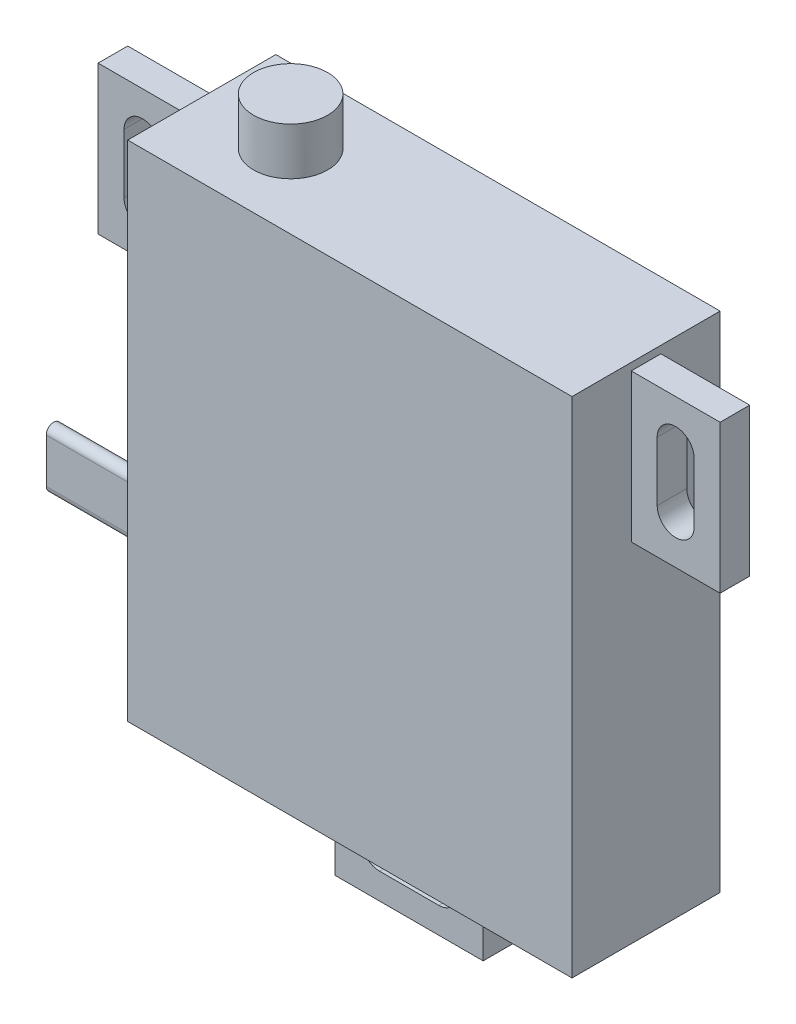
ISO-10303-21;
HEADER;
FILE_DESCRIPTION(('STEP AP214'),'2;1');
FILE_NAME('part.step','',(''),(''),'','','');
FILE_SCHEMA(('AUTOMOTIVE_DESIGN { 1 0 10303 214 1 1 1 1 }'));
ENDSEC;
DATA;
#1=APPLICATION_CONTEXT('core data for automotive mechanical design processes');
#2=APPLICATION_PROTOCOL_DEFINITION('international standard','automotive_design',2000,#1);
#3=PRODUCT_CONTEXT('',#1,'mechanical');
#4=PRODUCT('Part','Part','',(#3));
#5=PRODUCT_RELATED_PRODUCT_CATEGORY('part','',(#4));
#6=PRODUCT_DEFINITION_FORMATION('','',#4);
#7=PRODUCT_DEFINITION_CONTEXT('part definition',#1,'design');
#8=PRODUCT_DEFINITION('design','',#6,#7);
#9=PRODUCT_DEFINITION_SHAPE('','',#8);
#10=(LENGTH_UNIT() NAMED_UNIT(*) SI_UNIT(.MILLI.,.METRE.));
#11=(NAMED_UNIT(*) PLANE_ANGLE_UNIT() SI_UNIT($,.RADIAN.));
#12=(NAMED_UNIT(*) SI_UNIT($,.STERADIAN.) SOLID_ANGLE_UNIT());
#13=UNCERTAINTY_MEASURE_WITH_UNIT(LENGTH_MEASURE(1.E-05),#10,'distance_accuracy_value','');
#14=(GEOMETRIC_REPRESENTATION_CONTEXT(3) GLOBAL_UNCERTAINTY_ASSIGNED_CONTEXT((#13)) GLOBAL_UNIT_ASSIGNED_CONTEXT((#10,
#11,#12)) REPRESENTATION_CONTEXT('',''));
#15=CARTESIAN_POINT('',(0.,0.,0.));
#16=DIRECTION('',(0.,0.,1.));
#17=DIRECTION('',(1.,0.,0.));
#18=AXIS2_PLACEMENT_3D('',#15,#16,#17);
#19=CARTESIAN_POINT('',(0.,34.,5.));
#20=DIRECTION('',(0.,-1.,0.));
#21=DIRECTION('',(0.,0.,-1.));
#22=AXIS2_PLACEMENT_3D('',#19,#20,#21);
#23=PLANE('',#22);
#24=DIRECTION('',(-1.,0.,0.));
#25=VECTOR('',#24,1.);
#26=CARTESIAN_POINT('',(0.,34.,-5.));
#27=LINE('',#26,#25);
#28=CARTESIAN_POINT('',(30.,34.,-5.));
#29=VERTEX_POINT('',#28);
#30=CARTESIAN_POINT('',(0.,34.,-5.));
#31=VERTEX_POINT('',#30);
#32=EDGE_CURVE('E459',#29,#31,#27,.T.);
#33=ORIENTED_EDGE('',*,*,#32,.T.);
#34=DIRECTION('',(0.,0.,-1.));
#35=VECTOR('',#34,1.);
#36=CARTESIAN_POINT('',(0.,34.,5.));
#37=LINE('',#36,#35);
#38=CARTESIAN_POINT('',(0.,34.,5.));
#39=VERTEX_POINT('',#38);
#40=EDGE_CURVE('E465',#39,#31,#37,.T.);
#41=ORIENTED_EDGE('',*,*,#40,.F.);
#42=DIRECTION('',(-1.,0.,0.));
#43=VECTOR('',#42,1.);
#44=CARTESIAN_POINT('',(0.,34.,5.));
#45=LINE('',#44,#43);
#46=CARTESIAN_POINT('',(30.,34.,5.));
#47=VERTEX_POINT('',#46);
#48=EDGE_CURVE('E463',#47,#39,#45,.T.);
#49=ORIENTED_EDGE('',*,*,#48,.F.);
#50=DIRECTION('',(0.,0.,-1.));
#51=VECTOR('',#50,1.);
#52=CARTESIAN_POINT('',(30.,34.,5.));
#53=LINE('',#52,#51);
#54=EDGE_CURVE('E475',#47,#29,#53,.T.);
#55=ORIENTED_EDGE('',*,*,#54,.T.);
#56=EDGE_LOOP('',(#33,#41,#49,#55));
#57=FACE_BOUND('',#56,.T.);
#58=CARTESIAN_POINT('',(6.,34.,0.));
#59=DIRECTION('',(0.,-1.,0.));
#60=DIRECTION('',(0.,0.,-1.));
#61=AXIS2_PLACEMENT_3D('',#58,#59,#60);
#62=CIRCLE('',#61,2.5);
#63=CARTESIAN_POINT('',(6.,34.,-2.5));
#64=VERTEX_POINT('',#63);
#65=EDGE_CURVE('E11',#64,#64,#62,.F.);
#66=ORIENTED_EDGE('',*,*,#65,.F.);
#67=EDGE_LOOP('',(#66));
#68=FACE_BOUND('',#67,.T.);
#69=ADVANCED_FACE('F34',(#57,#68),#23,.F.);
#70=CARTESIAN_POINT('',(0.,0.,5.));
#71=DIRECTION('',(1.,0.,0.));
#72=DIRECTION('',(0.,0.,-1.));
#73=AXIS2_PLACEMENT_3D('',#70,#71,#72);
#74=PLANE('',#73);
#75=DIRECTION('',(0.,0.,-1.));
#76=VECTOR('',#75,1.);
#77=CARTESIAN_POINT('',(0.,33.5,1.));
#78=LINE('',#77,#76);
#79=CARTESIAN_POINT('',(0.,33.5,1.));
#80=VERTEX_POINT('',#79);
#81=CARTESIAN_POINT('',(0.,33.5,-1.));
#82=VERTEX_POINT('',#81);
#83=EDGE_CURVE('E390',#80,#82,#78,.T.);
#84=ORIENTED_EDGE('',*,*,#83,.F.);
#85=DIRECTION('',(0.,1.,0.));
#86=VECTOR('',#85,1.);
#87=CARTESIAN_POINT('',(0.,33.5,1.));
#88=LINE('',#87,#86);
#89=CARTESIAN_POINT('',(0.,23.5,1.));
#90=VERTEX_POINT('',#89);
#91=EDGE_CURVE('E364',#90,#80,#88,.T.);
#92=ORIENTED_EDGE('',*,*,#91,.F.);
#93=DIRECTION('',(0.,0.,-1.));
#94=VECTOR('',#93,1.);
#95=CARTESIAN_POINT('',(0.,23.5,1.));
#96=LINE('',#95,#94);
#97=CARTESIAN_POINT('',(0.,23.5,-1.));
#98=VERTEX_POINT('',#97);
#99=EDGE_CURVE('E375',#90,#98,#96,.T.);
#100=ORIENTED_EDGE('',*,*,#99,.T.);
#101=DIRECTION('',(0.,1.,0.));
#102=VECTOR('',#101,1.);
#103=CARTESIAN_POINT('',(0.,33.5,-1.));
#104=LINE('',#103,#102);
#105=EDGE_CURVE('E363',#98,#82,#104,.T.);
#106=ORIENTED_EDGE('',*,*,#105,.T.);
#107=EDGE_LOOP('',(#84,#92,#100,#106));
#108=FACE_BOUND('',#107,.T.);
#109=DIRECTION('',(0.,-1.,0.));
#110=VECTOR('',#109,1.);
#111=CARTESIAN_POINT('',(0.,0.,-5.));
#112=LINE('',#111,#110);
#113=CARTESIAN_POINT('',(0.,0.,-5.));
#114=VERTEX_POINT('',#113);
#115=EDGE_CURVE('E454',#31,#114,#112,.T.);
#116=ORIENTED_EDGE('',*,*,#115,.T.);
#117=DIRECTION('',(0.,0.,-1.));
#118=VECTOR('',#117,1.);
#119=CARTESIAN_POINT('',(0.,0.,5.));
#120=LINE('',#119,#118);
#121=CARTESIAN_POINT('',(0.,0.,5.));
#122=VERTEX_POINT('',#121);
#123=EDGE_CURVE('E42',#122,#114,#120,.T.);
#124=ORIENTED_EDGE('',*,*,#123,.F.);
#125=DIRECTION('',(0.,-1.,0.));
#126=VECTOR('',#125,1.);
#127=CARTESIAN_POINT('',(0.,0.,5.));
#128=LINE('',#127,#126);
#129=EDGE_CURVE('E455',#39,#122,#128,.T.);
#130=ORIENTED_EDGE('',*,*,#129,.F.);
#131=ORIENTED_EDGE('',*,*,#40,.T.);
#132=EDGE_LOOP('',(#116,#124,#130,#131));
#133=FACE_BOUND('',#132,.T.);
#134=CARTESIAN_POINT('',(0.,6.5,0.));
#135=DIRECTION('',(-1.,0.,0.));
#136=DIRECTION('',(0.,0.,-1.));
#137=AXIS2_PLACEMENT_3D('',#134,#135,#136);
#138=CIRCLE('',#137,0.5);
#139=CARTESIAN_POINT('',(0.,6.5,-0.499999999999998));
#140=VERTEX_POINT('',#139);
#141=CARTESIAN_POINT('',(0.,6.5,0.500000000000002));
#142=VERTEX_POINT('',#141);
#143=EDGE_CURVE('E263',#140,#142,#138,.T.);
#144=ORIENTED_EDGE('',*,*,#143,.F.);
#145=DIRECTION('',(0.,-1.,0.));
#146=VECTOR('',#145,1.);
#147=CARTESIAN_POINT('',(0.,6.5,-0.499999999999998));
#148=LINE('',#147,#146);
#149=CARTESIAN_POINT('',(0.,9.49999987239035,-0.499999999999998));
#150=VERTEX_POINT('',#149);
#151=EDGE_CURVE('E260',#150,#140,#148,.T.);
#152=ORIENTED_EDGE('',*,*,#151,.F.);
#153=CARTESIAN_POINT('',(0.,9.5,0.));
#154=DIRECTION('',(-1.,0.,0.));
#155=DIRECTION('',(0.,0.,-1.));
#156=AXIS2_PLACEMENT_3D('',#153,#154,#155);
#157=CIRCLE('',#156,0.500000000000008);
#158=CARTESIAN_POINT('',(0.,9.5,0.500000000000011));
#159=VERTEX_POINT('',#158);
#160=EDGE_CURVE('E54',#159,#150,#157,.T.);
#161=ORIENTED_EDGE('',*,*,#160,.F.);
#162=DIRECTION('',(0.,1.,0.));
#163=VECTOR('',#162,1.);
#164=CARTESIAN_POINT('',(0.,9.5,0.500000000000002));
#165=LINE('',#164,#163);
#166=EDGE_CURVE('E49',#142,#159,#165,.T.);
#167=ORIENTED_EDGE('',*,*,#166,.F.);
#168=EDGE_LOOP('',(#144,#152,#161,#167));
#169=FACE_BOUND('',#168,.T.);
#170=ADVANCED_FACE('F36',(#108,#133,#169),#74,.F.);
#171=CARTESIAN_POINT('',(0.,0.,5.));
#172=DIRECTION('',(0.,1.,0.));
#173=DIRECTION('',(0.,0.,1.));
#174=AXIS2_PLACEMENT_3D('',#171,#172,#173);
#175=PLANE('',#174);
#176=DIRECTION('',(1.,0.,0.));
#177=VECTOR('',#176,1.);
#178=CARTESIAN_POINT('',(0.,0.,-5.));
#179=LINE('',#178,#177);
#180=CARTESIAN_POINT('',(30.,0.,-5.));
#181=VERTEX_POINT('',#180);
#182=EDGE_CURVE('E468',#114,#181,#179,.T.);
#183=ORIENTED_EDGE('',*,*,#182,.T.);
#184=DIRECTION('',(0.,0.,-1.));
#185=VECTOR('',#184,1.);
#186=CARTESIAN_POINT('',(30.,0.,5.));
#187=LINE('',#186,#185);
#188=CARTESIAN_POINT('',(30.,0.,5.));
#189=VERTEX_POINT('',#188);
#190=EDGE_CURVE('E478',#189,#181,#187,.T.);
#191=ORIENTED_EDGE('',*,*,#190,.F.);
#192=DIRECTION('',(1.,0.,0.));
#193=VECTOR('',#192,1.);
#194=CARTESIAN_POINT('',(0.,0.,5.));
#195=LINE('',#194,#193);
#196=EDGE_CURVE('E458',#122,#189,#195,.T.);
#197=ORIENTED_EDGE('',*,*,#196,.F.);
#198=ORIENTED_EDGE('',*,*,#123,.T.);
#199=EDGE_LOOP('',(#183,#191,#197,#198));
#200=FACE_BOUND('',#199,.T.);
#201=DIRECTION('',(0.,0.,-1.));
#202=VECTOR('',#201,1.);
#203=CARTESIAN_POINT('',(10.,0.,1.));
#204=LINE('',#203,#202);
#205=CARTESIAN_POINT('',(10.,0.,1.));
#206=VERTEX_POINT('',#205);
#207=CARTESIAN_POINT('',(10.,0.,-1.));
#208=VERTEX_POINT('',#207);
#209=EDGE_CURVE('E313',#206,#208,#204,.T.);
#210=ORIENTED_EDGE('',*,*,#209,.F.);
#211=DIRECTION('',(-1.,0.,0.));
#212=VECTOR('',#211,1.);
#213=CARTESIAN_POINT('',(10.,0.,1.));
#214=LINE('',#213,#212);
#215=CARTESIAN_POINT('',(20.,0.,1.));
#216=VERTEX_POINT('',#215);
#217=EDGE_CURVE('E310',#216,#206,#214,.T.);
#218=ORIENTED_EDGE('',*,*,#217,.F.);
#219=DIRECTION('',(0.,0.,-1.));
#220=VECTOR('',#219,1.);
#221=CARTESIAN_POINT('',(20.,0.,1.));
#222=LINE('',#221,#220);
#223=CARTESIAN_POINT('',(20.,0.,-1.));
#224=VERTEX_POINT('',#223);
#225=EDGE_CURVE('E324',#216,#224,#222,.T.);
#226=ORIENTED_EDGE('',*,*,#225,.T.);
#227=DIRECTION('',(-1.,0.,0.));
#228=VECTOR('',#227,1.);
#229=CARTESIAN_POINT('',(10.,0.,-1.));
#230=LINE('',#229,#228);
#231=EDGE_CURVE('E305',#224,#208,#230,.T.);
#232=ORIENTED_EDGE('',*,*,#231,.T.);
#233=EDGE_LOOP('',(#210,#218,#226,#232));
#234=FACE_BOUND('',#233,.T.);
#235=ADVANCED_FACE('F483',(#200,#234),#175,.F.);
#236=CARTESIAN_POINT('',(30.,0.,5.));
#237=DIRECTION('',(-1.,0.,0.));
#238=DIRECTION('',(0.,-1.,0.));
#239=AXIS2_PLACEMENT_3D('',#236,#237,#238);
#240=PLANE('',#239);
#241=DIRECTION('',(0.,1.,0.));
#242=VECTOR('',#241,1.);
#243=CARTESIAN_POINT('',(30.,0.,-5.));
#244=LINE('',#243,#242);
#245=EDGE_CURVE('E470',#181,#29,#244,.T.);
#246=ORIENTED_EDGE('',*,*,#245,.T.);
#247=ORIENTED_EDGE('',*,*,#54,.F.);
#248=DIRECTION('',(0.,1.,0.));
#249=VECTOR('',#248,1.);
#250=CARTESIAN_POINT('',(30.,0.,5.));
#251=LINE('',#250,#249);
#252=EDGE_CURVE('E461',#189,#47,#251,.T.);
#253=ORIENTED_EDGE('',*,*,#252,.F.);
#254=ORIENTED_EDGE('',*,*,#190,.T.);
#255=EDGE_LOOP('',(#246,#247,#253,#254));
#256=FACE_BOUND('',#255,.T.);
#257=DIRECTION('',(0.,0.,-1.));
#258=VECTOR('',#257,1.);
#259=CARTESIAN_POINT('',(30.,23.5,1.));
#260=LINE('',#259,#258);
#261=CARTESIAN_POINT('',(30.,23.5,1.));
#262=VERTEX_POINT('',#261);
#263=CARTESIAN_POINT('',(30.,23.5,-1.));
#264=VERTEX_POINT('',#263);
#265=EDGE_CURVE('E451',#262,#264,#260,.T.);
#266=ORIENTED_EDGE('',*,*,#265,.F.);
#267=DIRECTION('',(0.,-1.,0.));
#268=VECTOR('',#267,1.);
#269=CARTESIAN_POINT('',(30.,33.5,1.));
#270=LINE('',#269,#268);
#271=CARTESIAN_POINT('',(30.,33.5,1.));
#272=VERTEX_POINT('',#271);
#273=EDGE_CURVE('E425',#272,#262,#270,.T.);
#274=ORIENTED_EDGE('',*,*,#273,.F.);
#275=DIRECTION('',(0.,0.,-1.));
#276=VECTOR('',#275,1.);
#277=CARTESIAN_POINT('',(30.,33.5,1.));
#278=LINE('',#277,#276);
#279=CARTESIAN_POINT('',(30.,33.5,-1.));
#280=VERTEX_POINT('',#279);
#281=EDGE_CURVE('E436',#272,#280,#278,.T.);
#282=ORIENTED_EDGE('',*,*,#281,.T.);
#283=DIRECTION('',(0.,-1.,0.));
#284=VECTOR('',#283,1.);
#285=CARTESIAN_POINT('',(30.,33.5,-1.));
#286=LINE('',#285,#284);
#287=EDGE_CURVE('E424',#280,#264,#286,.T.);
#288=ORIENTED_EDGE('',*,*,#287,.T.);
#289=EDGE_LOOP('',(#266,#274,#282,#288));
#290=FACE_BOUND('',#289,.T.);
#291=ADVANCED_FACE('F496',(#256,#290),#240,.F.);
#292=CARTESIAN_POINT('',(0.,34.,5.));
#293=DIRECTION('',(0.,0.,-1.));
#294=DIRECTION('',(-1.,0.,0.));
#295=AXIS2_PLACEMENT_3D('',#292,#293,#294);
#296=PLANE('',#295);
#297=ORIENTED_EDGE('',*,*,#129,.T.);
#298=ORIENTED_EDGE('',*,*,#196,.T.);
#299=ORIENTED_EDGE('',*,*,#252,.T.);
#300=ORIENTED_EDGE('',*,*,#48,.T.);
#301=EDGE_LOOP('',(#297,#298,#299,#300));
#302=FACE_BOUND('',#301,.T.);
#303=ADVANCED_FACE('F503',(#302),#296,.F.);
#304=CARTESIAN_POINT('',(0.,34.,-5.));
#305=DIRECTION('',(0.,0.,-1.));
#306=DIRECTION('',(-1.,0.,0.));
#307=AXIS2_PLACEMENT_3D('',#304,#305,#306);
#308=PLANE('',#307);
#309=ORIENTED_EDGE('',*,*,#115,.F.);
#310=ORIENTED_EDGE('',*,*,#32,.F.);
#311=ORIENTED_EDGE('',*,*,#245,.F.);
#312=ORIENTED_EDGE('',*,*,#182,.F.);
#313=EDGE_LOOP('',(#309,#310,#311,#312));
#314=FACE_BOUND('',#313,.T.);
#315=ADVANCED_FACE('F492',(#314),#308,.T.);
#316=CARTESIAN_POINT('',(30.,23.5,1.));
#317=DIRECTION('',(0.,0.,1.));
#318=DIRECTION('',(1.,0.,0.));
#319=AXIS2_PLACEMENT_3D('',#316,#317,#318);
#320=PLANE('',#319);
#321=ORIENTED_EDGE('',*,*,#273,.T.);
#322=DIRECTION('',(1.,0.,0.));
#323=VECTOR('',#322,1.);
#324=CARTESIAN_POINT('',(30.,23.5,1.));
#325=LINE('',#324,#323);
#326=CARTESIAN_POINT('',(36.,23.5,1.));
#327=VERTEX_POINT('',#326);
#328=EDGE_CURVE('E428',#262,#327,#325,.T.);
#329=ORIENTED_EDGE('',*,*,#328,.T.);
#330=DIRECTION('',(0.,1.,0.));
#331=VECTOR('',#330,1.);
#332=CARTESIAN_POINT('',(36.,33.5,1.));
#333=LINE('',#332,#331);
#334=CARTESIAN_POINT('',(36.,33.5,1.));
#335=VERTEX_POINT('',#334);
#336=EDGE_CURVE('E431',#327,#335,#333,.T.);
#337=ORIENTED_EDGE('',*,*,#336,.T.);
#338=DIRECTION('',(-1.,0.,0.));
#339=VECTOR('',#338,1.);
#340=CARTESIAN_POINT('',(30.,33.5,1.));
#341=LINE('',#340,#339);
#342=EDGE_CURVE('E433',#335,#272,#341,.T.);
#343=ORIENTED_EDGE('',*,*,#342,.T.);
#344=EDGE_LOOP('',(#321,#329,#337,#343));
#345=FACE_BOUND('',#344,.T.);
#346=DIRECTION('',(0.,-1.,0.));
#347=VECTOR('',#346,1.);
#348=CARTESIAN_POINT('',(31.75,30.5,1.));
#349=LINE('',#348,#347);
#350=CARTESIAN_POINT('',(31.75,30.5,1.));
#351=VERTEX_POINT('',#350);
#352=CARTESIAN_POINT('',(31.75,26.5,1.));
#353=VERTEX_POINT('',#352);
#354=EDGE_CURVE('E396',#351,#353,#349,.T.);
#355=ORIENTED_EDGE('',*,*,#354,.F.);
#356=CARTESIAN_POINT('',(33.,30.5,1.));
#357=DIRECTION('',(0.,0.,1.));
#358=DIRECTION('',(1.,0.,0.));
#359=AXIS2_PLACEMENT_3D('',#356,#357,#358);
#360=CIRCLE('',#359,1.25);
#361=CARTESIAN_POINT('',(34.25,30.5,1.));
#362=VERTEX_POINT('',#361);
#363=EDGE_CURVE('E394',#362,#351,#360,.T.);
#364=ORIENTED_EDGE('',*,*,#363,.F.);
#365=DIRECTION('',(0.,1.,0.));
#366=VECTOR('',#365,1.);
#367=CARTESIAN_POINT('',(34.25,30.5,1.));
#368=LINE('',#367,#366);
#369=CARTESIAN_POINT('',(34.25,26.5,1.));
#370=VERTEX_POINT('',#369);
#371=EDGE_CURVE('E402',#370,#362,#368,.T.);
#372=ORIENTED_EDGE('',*,*,#371,.F.);
#373=CARTESIAN_POINT('',(33.,26.5,1.));
#374=DIRECTION('',(0.,0.,1.));
#375=DIRECTION('',(1.,0.,0.));
#376=AXIS2_PLACEMENT_3D('',#373,#374,#375);
#377=CIRCLE('',#376,1.25);
#378=EDGE_CURVE('E399',#353,#370,#377,.T.);
#379=ORIENTED_EDGE('',*,*,#378,.F.);
#380=EDGE_LOOP('',(#355,#364,#372,#379));
#381=FACE_BOUND('',#380,.T.);
#382=ADVANCED_FACE('F510',(#345,#381),#320,.T.);
#383=CARTESIAN_POINT('',(30.,23.5,-1.));
#384=DIRECTION('',(0.,0.,1.));
#385=DIRECTION('',(1.,0.,0.));
#386=AXIS2_PLACEMENT_3D('',#383,#384,#385);
#387=PLANE('',#386);
#388=ORIENTED_EDGE('',*,*,#287,.F.);
#389=DIRECTION('',(-1.,0.,0.));
#390=VECTOR('',#389,1.);
#391=CARTESIAN_POINT('',(30.,33.5,-1.));
#392=LINE('',#391,#390);
#393=CARTESIAN_POINT('',(36.,33.5,-1.));
#394=VERTEX_POINT('',#393);
#395=EDGE_CURVE('E429',#394,#280,#392,.T.);
#396=ORIENTED_EDGE('',*,*,#395,.F.);
#397=DIRECTION('',(0.,1.,0.));
#398=VECTOR('',#397,1.);
#399=CARTESIAN_POINT('',(36.,33.5,-1.));
#400=LINE('',#399,#398);
#401=CARTESIAN_POINT('',(36.,23.5,-1.));
#402=VERTEX_POINT('',#401);
#403=EDGE_CURVE('E440',#402,#394,#400,.T.);
#404=ORIENTED_EDGE('',*,*,#403,.F.);
#405=DIRECTION('',(1.,0.,0.));
#406=VECTOR('',#405,1.);
#407=CARTESIAN_POINT('',(30.,23.5,-1.));
#408=LINE('',#407,#406);
#409=EDGE_CURVE('E438',#264,#402,#408,.T.);
#410=ORIENTED_EDGE('',*,*,#409,.F.);
#411=EDGE_LOOP('',(#388,#396,#404,#410));
#412=FACE_BOUND('',#411,.T.);
#413=CARTESIAN_POINT('',(33.,30.5,-1.));
#414=DIRECTION('',(0.,0.,1.));
#415=DIRECTION('',(1.,0.,0.));
#416=AXIS2_PLACEMENT_3D('',#413,#414,#415);
#417=CIRCLE('',#416,1.25);
#418=CARTESIAN_POINT('',(34.25,30.5,-1.));
#419=VERTEX_POINT('',#418);
#420=CARTESIAN_POINT('',(31.75,30.5,-1.));
#421=VERTEX_POINT('',#420);
#422=EDGE_CURVE('E393',#419,#421,#417,.T.);
#423=ORIENTED_EDGE('',*,*,#422,.T.);
#424=DIRECTION('',(0.,-1.,0.));
#425=VECTOR('',#424,1.);
#426=CARTESIAN_POINT('',(31.75,30.5,-1.));
#427=LINE('',#426,#425);
#428=CARTESIAN_POINT('',(31.75,26.5,-1.));
#429=VERTEX_POINT('',#428);
#430=EDGE_CURVE('E407',#421,#429,#427,.T.);
#431=ORIENTED_EDGE('',*,*,#430,.T.);
#432=CARTESIAN_POINT('',(33.,26.5,-1.));
#433=DIRECTION('',(0.,0.,1.));
#434=DIRECTION('',(1.,0.,0.));
#435=AXIS2_PLACEMENT_3D('',#432,#433,#434);
#436=CIRCLE('',#435,1.25);
#437=CARTESIAN_POINT('',(34.25,26.5,-1.));
#438=VERTEX_POINT('',#437);
#439=EDGE_CURVE('E410',#429,#438,#436,.T.);
#440=ORIENTED_EDGE('',*,*,#439,.T.);
#441=DIRECTION('',(0.,1.,0.));
#442=VECTOR('',#441,1.);
#443=CARTESIAN_POINT('',(34.25,30.5,-1.));
#444=LINE('',#443,#442);
#445=EDGE_CURVE('E397',#438,#419,#444,.T.);
#446=ORIENTED_EDGE('',*,*,#445,.T.);
#447=EDGE_LOOP('',(#423,#431,#440,#446));
#448=FACE_BOUND('',#447,.T.);
#449=ADVANCED_FACE('F540',(#412,#448),#387,.F.);
#450=CARTESIAN_POINT('',(30.,23.5,1.));
#451=DIRECTION('',(0.,1.,0.));
#452=DIRECTION('',(0.,0.,1.));
#453=AXIS2_PLACEMENT_3D('',#450,#451,#452);
#454=PLANE('',#453);
#455=ORIENTED_EDGE('',*,*,#409,.T.);
#456=DIRECTION('',(0.,0.,-1.));
#457=VECTOR('',#456,1.);
#458=CARTESIAN_POINT('',(36.,23.5,1.));
#459=LINE('',#458,#457);
#460=EDGE_CURVE('E448',#327,#402,#459,.T.);
#461=ORIENTED_EDGE('',*,*,#460,.F.);
#462=ORIENTED_EDGE('',*,*,#328,.F.);
#463=ORIENTED_EDGE('',*,*,#265,.T.);
#464=EDGE_LOOP('',(#455,#461,#462,#463));
#465=FACE_BOUND('',#464,.T.);
#466=ADVANCED_FACE('F550',(#465),#454,.F.);
#467=CARTESIAN_POINT('',(36.,33.5,1.));
#468=DIRECTION('',(-1.,0.,0.));
#469=DIRECTION('',(0.,0.,1.));
#470=AXIS2_PLACEMENT_3D('',#467,#468,#469);
#471=PLANE('',#470);
#472=ORIENTED_EDGE('',*,*,#403,.T.);
#473=DIRECTION('',(0.,0.,-1.));
#474=VECTOR('',#473,1.);
#475=CARTESIAN_POINT('',(36.,33.5,1.));
#476=LINE('',#475,#474);
#477=EDGE_CURVE('E445',#335,#394,#476,.T.);
#478=ORIENTED_EDGE('',*,*,#477,.F.);
#479=ORIENTED_EDGE('',*,*,#336,.F.);
#480=ORIENTED_EDGE('',*,*,#460,.T.);
#481=EDGE_LOOP('',(#472,#478,#479,#480));
#482=FACE_BOUND('',#481,.T.);
#483=ADVANCED_FACE('F560',(#482),#471,.F.);
#484=CARTESIAN_POINT('',(30.,33.5,1.));
#485=DIRECTION('',(0.,-1.,0.));
#486=DIRECTION('',(0.,0.,-1.));
#487=AXIS2_PLACEMENT_3D('',#484,#485,#486);
#488=PLANE('',#487);
#489=ORIENTED_EDGE('',*,*,#395,.T.);
#490=ORIENTED_EDGE('',*,*,#281,.F.);
#491=ORIENTED_EDGE('',*,*,#342,.F.);
#492=ORIENTED_EDGE('',*,*,#477,.T.);
#493=EDGE_LOOP('',(#489,#490,#491,#492));
#494=FACE_BOUND('',#493,.T.);
#495=ADVANCED_FACE('F569',(#494),#488,.F.);
#496=CARTESIAN_POINT('',(33.,30.5,1.));
#497=DIRECTION('',(0.,0.,-1.));
#498=DIRECTION('',(-1.,0.,0.));
#499=AXIS2_PLACEMENT_3D('',#496,#497,#498);
#500=CYLINDRICAL_SURFACE('',#499,1.25);
#501=ORIENTED_EDGE('',*,*,#422,.F.);
#502=DIRECTION('',(0.,0.,-1.));
#503=VECTOR('',#502,1.);
#504=CARTESIAN_POINT('',(34.25,30.5,1.));
#505=LINE('',#504,#503);
#506=EDGE_CURVE('E404',#362,#419,#505,.T.);
#507=ORIENTED_EDGE('',*,*,#506,.F.);
#508=ORIENTED_EDGE('',*,*,#363,.T.);
#509=DIRECTION('',(0.,0.,-1.));
#510=VECTOR('',#509,1.);
#511=CARTESIAN_POINT('',(31.75,30.5,1.));
#512=LINE('',#511,#510);
#513=EDGE_CURVE('E421',#351,#421,#512,.T.);
#514=ORIENTED_EDGE('',*,*,#513,.T.);
#515=EDGE_LOOP('',(#501,#507,#508,#514));
#516=FACE_BOUND('',#515,.T.);
#517=ADVANCED_FACE('F579',(#516),#500,.F.);
#518=CARTESIAN_POINT('',(31.75,30.5,1.));
#519=DIRECTION('',(1.,0.,0.));
#520=DIRECTION('',(0.,0.,-1.));
#521=AXIS2_PLACEMENT_3D('',#518,#519,#520);
#522=PLANE('',#521);
#523=ORIENTED_EDGE('',*,*,#430,.F.);
#524=ORIENTED_EDGE('',*,*,#513,.F.);
#525=ORIENTED_EDGE('',*,*,#354,.T.);
#526=DIRECTION('',(0.,0.,-1.));
#527=VECTOR('',#526,1.);
#528=CARTESIAN_POINT('',(31.75,26.5,1.));
#529=LINE('',#528,#527);
#530=EDGE_CURVE('E419',#353,#429,#529,.T.);
#531=ORIENTED_EDGE('',*,*,#530,.T.);
#532=EDGE_LOOP('',(#523,#524,#525,#531));
#533=FACE_BOUND('',#532,.T.);
#534=ADVANCED_FACE('F589',(#533),#522,.T.);
#535=CARTESIAN_POINT('',(33.,26.5,1.));
#536=DIRECTION('',(0.,0.,-1.));
#537=DIRECTION('',(-1.,0.,0.));
#538=AXIS2_PLACEMENT_3D('',#535,#536,#537);
#539=CYLINDRICAL_SURFACE('',#538,1.25);
#540=ORIENTED_EDGE('',*,*,#439,.F.);
#541=ORIENTED_EDGE('',*,*,#530,.F.);
#542=ORIENTED_EDGE('',*,*,#378,.T.);
#543=DIRECTION('',(0.,0.,-1.));
#544=VECTOR('',#543,1.);
#545=CARTESIAN_POINT('',(34.25,26.5,1.));
#546=LINE('',#545,#544);
#547=EDGE_CURVE('E417',#370,#438,#546,.T.);
#548=ORIENTED_EDGE('',*,*,#547,.T.);
#549=EDGE_LOOP('',(#540,#541,#542,#548));
#550=FACE_BOUND('',#549,.T.);
#551=ADVANCED_FACE('F599',(#550),#539,.F.);
#552=CARTESIAN_POINT('',(34.25,30.5,1.));
#553=DIRECTION('',(-1.,0.,0.));
#554=DIRECTION('',(0.,-1.,0.));
#555=AXIS2_PLACEMENT_3D('',#552,#553,#554);
#556=PLANE('',#555);
#557=ORIENTED_EDGE('',*,*,#445,.F.);
#558=ORIENTED_EDGE('',*,*,#547,.F.);
#559=ORIENTED_EDGE('',*,*,#371,.T.);
#560=ORIENTED_EDGE('',*,*,#506,.T.);
#561=EDGE_LOOP('',(#557,#558,#559,#560));
#562=FACE_BOUND('',#561,.T.);
#563=ADVANCED_FACE('F609',(#562),#556,.T.);
#564=CARTESIAN_POINT('',(0.,23.5,1.));
#565=DIRECTION('',(0.,0.,-1.));
#566=DIRECTION('',(-1.,0.,0.));
#567=AXIS2_PLACEMENT_3D('',#564,#565,#566);
#568=PLANE('',#567);
#569=ORIENTED_EDGE('',*,*,#91,.T.);
#570=DIRECTION('',(-1.,0.,0.));
#571=VECTOR('',#570,1.);
#572=CARTESIAN_POINT('',(0.,33.5,1.));
#573=LINE('',#572,#571);
#574=CARTESIAN_POINT('',(-6.,33.5,1.));
#575=VERTEX_POINT('',#574);
#576=EDGE_CURVE('E367',#80,#575,#573,.T.);
#577=ORIENTED_EDGE('',*,*,#576,.T.);
#578=DIRECTION('',(0.,-1.,0.));
#579=VECTOR('',#578,1.);
#580=CARTESIAN_POINT('',(-6.,33.5,1.));
#581=LINE('',#580,#579);
#582=CARTESIAN_POINT('',(-6.,23.5,1.));
#583=VERTEX_POINT('',#582);
#584=EDGE_CURVE('E370',#575,#583,#581,.T.);
#585=ORIENTED_EDGE('',*,*,#584,.T.);
#586=DIRECTION('',(1.,0.,0.));
#587=VECTOR('',#586,1.);
#588=CARTESIAN_POINT('',(0.,23.5,1.));
#589=LINE('',#588,#587);
#590=EDGE_CURVE('E372',#583,#90,#589,.T.);
#591=ORIENTED_EDGE('',*,*,#590,.T.);
#592=EDGE_LOOP('',(#569,#577,#585,#591));
#593=FACE_BOUND('',#592,.T.);
#594=CARTESIAN_POINT('',(-3.,30.5,1.));
#595=DIRECTION('',(0.,0.,1.));
#596=DIRECTION('',(1.,0.,0.));
#597=AXIS2_PLACEMENT_3D('',#594,#595,#596);
#598=CIRCLE('',#597,1.25);
#599=CARTESIAN_POINT('',(-1.75,30.5,1.));
#600=VERTEX_POINT('',#599);
#601=CARTESIAN_POINT('',(-4.25,30.5,1.));
#602=VERTEX_POINT('',#601);
#603=EDGE_CURVE('E333',#600,#602,#598,.T.);
#604=ORIENTED_EDGE('',*,*,#603,.F.);
#605=DIRECTION('',(0.,1.,0.));
#606=VECTOR('',#605,1.);
#607=CARTESIAN_POINT('',(-1.75,30.5,1.));
#608=LINE('',#607,#606);
#609=CARTESIAN_POINT('',(-1.75,26.5,1.));
#610=VERTEX_POINT('',#609);
#611=EDGE_CURVE('E341',#610,#600,#608,.T.);
#612=ORIENTED_EDGE('',*,*,#611,.F.);
#613=CARTESIAN_POINT('',(-3.,26.5,1.));
#614=DIRECTION('',(0.,0.,1.));
#615=DIRECTION('',(1.,0.,0.));
#616=AXIS2_PLACEMENT_3D('',#613,#614,#615);
#617=CIRCLE('',#616,1.25);
#618=CARTESIAN_POINT('',(-4.25000000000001,26.5,1.));
#619=VERTEX_POINT('',#618);
#620=EDGE_CURVE('E338',#619,#610,#617,.T.);
#621=ORIENTED_EDGE('',*,*,#620,.F.);
#622=DIRECTION('',(0.,-1.,0.));
#623=VECTOR('',#622,1.);
#624=CARTESIAN_POINT('',(-4.25,30.5,1.));
#625=LINE('',#624,#623);
#626=EDGE_CURVE('E335',#602,#619,#625,.T.);
#627=ORIENTED_EDGE('',*,*,#626,.F.);
#628=EDGE_LOOP('',(#604,#612,#621,#627));
#629=FACE_BOUND('',#628,.T.);
#630=ADVANCED_FACE('F619',(#593,#629),#568,.F.);
#631=CARTESIAN_POINT('',(0.,23.5,-1.));
#632=DIRECTION('',(0.,0.,-1.));
#633=DIRECTION('',(-1.,0.,0.));
#634=AXIS2_PLACEMENT_3D('',#631,#632,#633);
#635=PLANE('',#634);
#636=ORIENTED_EDGE('',*,*,#105,.F.);
#637=DIRECTION('',(1.,0.,0.));
#638=VECTOR('',#637,1.);
#639=CARTESIAN_POINT('',(0.,23.5,-1.));
#640=LINE('',#639,#638);
#641=CARTESIAN_POINT('',(-6.,23.5,-1.));
#642=VERTEX_POINT('',#641);
#643=EDGE_CURVE('E368',#642,#98,#640,.T.);
#644=ORIENTED_EDGE('',*,*,#643,.F.);
#645=DIRECTION('',(0.,-1.,0.));
#646=VECTOR('',#645,1.);
#647=CARTESIAN_POINT('',(-6.,33.5,-1.));
#648=LINE('',#647,#646);
#649=CARTESIAN_POINT('',(-6.,33.5,-1.));
#650=VERTEX_POINT('',#649);
#651=EDGE_CURVE('E379',#650,#642,#648,.T.);
#652=ORIENTED_EDGE('',*,*,#651,.F.);
#653=DIRECTION('',(-1.,0.,0.));
#654=VECTOR('',#653,1.);
#655=CARTESIAN_POINT('',(0.,33.5,-1.));
#656=LINE('',#655,#654);
#657=EDGE_CURVE('E377',#82,#650,#656,.T.);
#658=ORIENTED_EDGE('',*,*,#657,.F.);
#659=EDGE_LOOP('',(#636,#644,#652,#658));
#660=FACE_BOUND('',#659,.T.);
#661=DIRECTION('',(0.,1.,0.));
#662=VECTOR('',#661,1.);
#663=CARTESIAN_POINT('',(-1.75,30.5,-1.));
#664=LINE('',#663,#662);
#665=CARTESIAN_POINT('',(-1.75,26.5,-1.));
#666=VERTEX_POINT('',#665);
#667=CARTESIAN_POINT('',(-1.75,30.5,-1.));
#668=VERTEX_POINT('',#667);
#669=EDGE_CURVE('E336',#666,#668,#664,.T.);
#670=ORIENTED_EDGE('',*,*,#669,.T.);
#671=CARTESIAN_POINT('',(-3.,30.5,-1.));
#672=DIRECTION('',(0.,0.,1.));
#673=DIRECTION('',(1.,0.,0.));
#674=AXIS2_PLACEMENT_3D('',#671,#672,#673);
#675=CIRCLE('',#674,1.25);
#676=CARTESIAN_POINT('',(-4.25,30.5,-1.));
#677=VERTEX_POINT('',#676);
#678=EDGE_CURVE('E332',#668,#677,#675,.T.);
#679=ORIENTED_EDGE('',*,*,#678,.T.);
#680=DIRECTION('',(0.,-1.,0.));
#681=VECTOR('',#680,1.);
#682=CARTESIAN_POINT('',(-4.25,30.5,-1.));
#683=LINE('',#682,#681);
#684=CARTESIAN_POINT('',(-4.25000000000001,26.5,-1.));
#685=VERTEX_POINT('',#684);
#686=EDGE_CURVE('E346',#677,#685,#683,.T.);
#687=ORIENTED_EDGE('',*,*,#686,.T.);
#688=CARTESIAN_POINT('',(-3.,26.5,-1.));
#689=DIRECTION('',(0.,0.,1.));
#690=DIRECTION('',(1.,0.,0.));
#691=AXIS2_PLACEMENT_3D('',#688,#689,#690);
#692=CIRCLE('',#691,1.25);
#693=EDGE_CURVE('E349',#685,#666,#692,.T.);
#694=ORIENTED_EDGE('',*,*,#693,.T.);
#695=EDGE_LOOP('',(#670,#679,#687,#694));
#696=FACE_BOUND('',#695,.T.);
#697=ADVANCED_FACE('F629',(#660,#696),#635,.T.);
#698=CARTESIAN_POINT('',(0.,33.5,1.));
#699=DIRECTION('',(0.,-1.,0.));
#700=DIRECTION('',(0.,0.,-1.));
#701=AXIS2_PLACEMENT_3D('',#698,#699,#700);
#702=PLANE('',#701);
#703=ORIENTED_EDGE('',*,*,#657,.T.);
#704=DIRECTION('',(0.,0.,-1.));
#705=VECTOR('',#704,1.);
#706=CARTESIAN_POINT('',(-6.,33.5,1.));
#707=LINE('',#706,#705);
#708=EDGE_CURVE('E387',#575,#650,#707,.T.);
#709=ORIENTED_EDGE('',*,*,#708,.F.);
#710=ORIENTED_EDGE('',*,*,#576,.F.);
#711=ORIENTED_EDGE('',*,*,#83,.T.);
#712=EDGE_LOOP('',(#703,#709,#710,#711));
#713=FACE_BOUND('',#712,.T.);
#714=ADVANCED_FACE('F639',(#713),#702,.F.);
#715=CARTESIAN_POINT('',(-6.,33.5,1.));
#716=DIRECTION('',(1.,0.,0.));
#717=DIRECTION('',(0.,0.,-1.));
#718=AXIS2_PLACEMENT_3D('',#715,#716,#717);
#719=PLANE('',#718);
#720=ORIENTED_EDGE('',*,*,#651,.T.);
#721=DIRECTION('',(0.,0.,-1.));
#722=VECTOR('',#721,1.);
#723=CARTESIAN_POINT('',(-6.,23.5,1.));
#724=LINE('',#723,#722);
#725=EDGE_CURVE('E384',#583,#642,#724,.T.);
#726=ORIENTED_EDGE('',*,*,#725,.F.);
#727=ORIENTED_EDGE('',*,*,#584,.F.);
#728=ORIENTED_EDGE('',*,*,#708,.T.);
#729=EDGE_LOOP('',(#720,#726,#727,#728));
#730=FACE_BOUND('',#729,.T.);
#731=ADVANCED_FACE('F649',(#730),#719,.F.);
#732=CARTESIAN_POINT('',(0.,23.5,1.));
#733=DIRECTION('',(0.,1.,0.));
#734=DIRECTION('',(0.,0.,1.));
#735=AXIS2_PLACEMENT_3D('',#732,#733,#734);
#736=PLANE('',#735);
#737=ORIENTED_EDGE('',*,*,#643,.T.);
#738=ORIENTED_EDGE('',*,*,#99,.F.);
#739=ORIENTED_EDGE('',*,*,#590,.F.);
#740=ORIENTED_EDGE('',*,*,#725,.T.);
#741=EDGE_LOOP('',(#737,#738,#739,#740));
#742=FACE_BOUND('',#741,.T.);
#743=ADVANCED_FACE('F659',(#742),#736,.F.);
#744=CARTESIAN_POINT('',(-3.,30.5,1.));
#745=DIRECTION('',(0.,0.,-1.));
#746=DIRECTION('',(-1.,0.,0.));
#747=AXIS2_PLACEMENT_3D('',#744,#745,#746);
#748=CYLINDRICAL_SURFACE('',#747,1.25);
#749=ORIENTED_EDGE('',*,*,#678,.F.);
#750=DIRECTION('',(0.,0.,-1.));
#751=VECTOR('',#750,1.);
#752=CARTESIAN_POINT('',(-1.75,30.5,1.));
#753=LINE('',#752,#751);
#754=EDGE_CURVE('E343',#600,#668,#753,.T.);
#755=ORIENTED_EDGE('',*,*,#754,.F.);
#756=ORIENTED_EDGE('',*,*,#603,.T.);
#757=DIRECTION('',(0.,0.,-1.));
#758=VECTOR('',#757,1.);
#759=CARTESIAN_POINT('',(-4.25,30.5,1.));
#760=LINE('',#759,#758);
#761=EDGE_CURVE('E360',#602,#677,#760,.T.);
#762=ORIENTED_EDGE('',*,*,#761,.T.);
#763=EDGE_LOOP('',(#749,#755,#756,#762));
#764=FACE_BOUND('',#763,.T.);
#765=ADVANCED_FACE('F669',(#764),#748,.F.);
#766=CARTESIAN_POINT('',(-4.25,30.5,1.));
#767=DIRECTION('',(1.,0.,0.));
#768=DIRECTION('',(0.,1.,0.));
#769=AXIS2_PLACEMENT_3D('',#766,#767,#768);
#770=PLANE('',#769);
#771=ORIENTED_EDGE('',*,*,#686,.F.);
#772=ORIENTED_EDGE('',*,*,#761,.F.);
#773=ORIENTED_EDGE('',*,*,#626,.T.);
#774=DIRECTION('',(0.,0.,-1.));
#775=VECTOR('',#774,1.);
#776=CARTESIAN_POINT('',(-4.25000000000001,26.5,1.));
#777=LINE('',#776,#775);
#778=EDGE_CURVE('E358',#619,#685,#777,.T.);
#779=ORIENTED_EDGE('',*,*,#778,.T.);
#780=EDGE_LOOP('',(#771,#772,#773,#779));
#781=FACE_BOUND('',#780,.T.);
#782=ADVANCED_FACE('F679',(#781),#770,.T.);
#783=CARTESIAN_POINT('',(-3.,26.5,1.));
#784=DIRECTION('',(0.,0.,-1.));
#785=DIRECTION('',(-1.,0.,0.));
#786=AXIS2_PLACEMENT_3D('',#783,#784,#785);
#787=CYLINDRICAL_SURFACE('',#786,1.25);
#788=ORIENTED_EDGE('',*,*,#693,.F.);
#789=ORIENTED_EDGE('',*,*,#778,.F.);
#790=ORIENTED_EDGE('',*,*,#620,.T.);
#791=DIRECTION('',(0.,0.,-1.));
#792=VECTOR('',#791,1.);
#793=CARTESIAN_POINT('',(-1.75,26.5,1.));
#794=LINE('',#793,#792);
#795=EDGE_CURVE('E356',#610,#666,#794,.T.);
#796=ORIENTED_EDGE('',*,*,#795,.T.);
#797=EDGE_LOOP('',(#788,#789,#790,#796));
#798=FACE_BOUND('',#797,.T.);
#799=ADVANCED_FACE('F689',(#798),#787,.F.);
#800=CARTESIAN_POINT('',(-1.75,30.5,1.));
#801=DIRECTION('',(-1.,0.,0.));
#802=DIRECTION('',(0.,0.,1.));
#803=AXIS2_PLACEMENT_3D('',#800,#801,#802);
#804=PLANE('',#803);
#805=ORIENTED_EDGE('',*,*,#669,.F.);
#806=ORIENTED_EDGE('',*,*,#795,.F.);
#807=ORIENTED_EDGE('',*,*,#611,.T.);
#808=ORIENTED_EDGE('',*,*,#754,.T.);
#809=EDGE_LOOP('',(#805,#806,#807,#808));
#810=FACE_BOUND('',#809,.T.);
#811=ADVANCED_FACE('F699',(#810),#804,.T.);
#812=CARTESIAN_POINT('',(10.,-6.,1.));
#813=DIRECTION('',(0.,0.,1.));
#814=DIRECTION('',(1.,0.,0.));
#815=AXIS2_PLACEMENT_3D('',#812,#813,#814);
#816=PLANE('',#815);
#817=DIRECTION('',(0.,-1.,0.));
#818=VECTOR('',#817,1.);
#819=CARTESIAN_POINT('',(10.,0.,1.));
#820=LINE('',#819,#818);
#821=CARTESIAN_POINT('',(10.,-6.,1.));
#822=VERTEX_POINT('',#821);
#823=EDGE_CURVE('E301',#206,#822,#820,.T.);
#824=ORIENTED_EDGE('',*,*,#823,.T.);
#825=DIRECTION('',(1.,0.,0.));
#826=VECTOR('',#825,1.);
#827=CARTESIAN_POINT('',(10.,-6.,1.));
#828=LINE('',#827,#826);
#829=CARTESIAN_POINT('',(20.,-6.,1.));
#830=VERTEX_POINT('',#829);
#831=EDGE_CURVE('E304',#822,#830,#828,.T.);
#832=ORIENTED_EDGE('',*,*,#831,.T.);
#833=DIRECTION('',(0.,1.,0.));
#834=VECTOR('',#833,1.);
#835=CARTESIAN_POINT('',(20.,0.,1.));
#836=LINE('',#835,#834);
#837=EDGE_CURVE('E307',#830,#216,#836,.T.);
#838=ORIENTED_EDGE('',*,*,#837,.T.);
#839=ORIENTED_EDGE('',*,*,#217,.T.);
#840=EDGE_LOOP('',(#824,#832,#838,#839));
#841=FACE_BOUND('',#840,.T.);
#842=DIRECTION('',(-1.,0.,0.));
#843=VECTOR('',#842,1.);
#844=CARTESIAN_POINT('',(17.,-1.75,1.));
#845=LINE('',#844,#843);
#846=CARTESIAN_POINT('',(17.,-1.75,1.));
#847=VERTEX_POINT('',#846);
#848=CARTESIAN_POINT('',(13.,-1.75,1.));
#849=VERTEX_POINT('',#848);
#850=EDGE_CURVE('E275',#847,#849,#845,.T.);
#851=ORIENTED_EDGE('',*,*,#850,.F.);
#852=CARTESIAN_POINT('',(17.,-3.,1.));
#853=DIRECTION('',(0.,0.,1.));
#854=DIRECTION('',(1.,0.,0.));
#855=AXIS2_PLACEMENT_3D('',#852,#853,#854);
#856=CIRCLE('',#855,1.25);
#857=CARTESIAN_POINT('',(17.,-4.25,1.));
#858=VERTEX_POINT('',#857);
#859=EDGE_CURVE('E273',#858,#847,#856,.T.);
#860=ORIENTED_EDGE('',*,*,#859,.F.);
#861=DIRECTION('',(1.,0.,0.));
#862=VECTOR('',#861,1.);
#863=CARTESIAN_POINT('',(13.,-4.25,1.));
#864=LINE('',#863,#862);
#865=CARTESIAN_POINT('',(13.,-4.25,1.));
#866=VERTEX_POINT('',#865);
#867=EDGE_CURVE('E281',#866,#858,#864,.T.);
#868=ORIENTED_EDGE('',*,*,#867,.F.);
#869=CARTESIAN_POINT('',(13.,-3.,1.));
#870=DIRECTION('',(0.,0.,1.));
#871=DIRECTION('',(1.,0.,0.));
#872=AXIS2_PLACEMENT_3D('',#869,#870,#871);
#873=CIRCLE('',#872,1.25);
#874=EDGE_CURVE('E278',#849,#866,#873,.T.);
#875=ORIENTED_EDGE('',*,*,#874,.F.);
#876=EDGE_LOOP('',(#851,#860,#868,#875));
#877=FACE_BOUND('',#876,.T.);
#878=ADVANCED_FACE('F709',(#841,#877),#816,.T.);
#879=CARTESIAN_POINT('',(10.,-6.,-1.));
#880=DIRECTION('',(0.,0.,1.));
#881=DIRECTION('',(1.,0.,0.));
#882=AXIS2_PLACEMENT_3D('',#879,#880,#881);
#883=PLANE('',#882);
#884=DIRECTION('',(0.,-1.,0.));
#885=VECTOR('',#884,1.);
#886=CARTESIAN_POINT('',(10.,0.,-1.));
#887=LINE('',#886,#885);
#888=CARTESIAN_POINT('',(10.,-6.,-1.));
#889=VERTEX_POINT('',#888);
#890=EDGE_CURVE('E300',#208,#889,#887,.T.);
#891=ORIENTED_EDGE('',*,*,#890,.F.);
#892=ORIENTED_EDGE('',*,*,#231,.F.);
#893=DIRECTION('',(0.,1.,0.));
#894=VECTOR('',#893,1.);
#895=CARTESIAN_POINT('',(20.,0.,-1.));
#896=LINE('',#895,#894);
#897=CARTESIAN_POINT('',(20.,-6.,-1.));
#898=VERTEX_POINT('',#897);
#899=EDGE_CURVE('E318',#898,#224,#896,.T.);
#900=ORIENTED_EDGE('',*,*,#899,.F.);
#901=DIRECTION('',(1.,0.,0.));
#902=VECTOR('',#901,1.);
#903=CARTESIAN_POINT('',(10.,-6.,-1.));
#904=LINE('',#903,#902);
#905=EDGE_CURVE('E316',#889,#898,#904,.T.);
#906=ORIENTED_EDGE('',*,*,#905,.F.);
#907=EDGE_LOOP('',(#891,#892,#900,#906));
#908=FACE_BOUND('',#907,.T.);
#909=CARTESIAN_POINT('',(17.,-3.,-1.));
#910=DIRECTION('',(0.,0.,1.));
#911=DIRECTION('',(1.,0.,0.));
#912=AXIS2_PLACEMENT_3D('',#909,#910,#911);
#913=CIRCLE('',#912,1.25);
#914=CARTESIAN_POINT('',(17.,-4.25,-1.));
#915=VERTEX_POINT('',#914);
#916=CARTESIAN_POINT('',(17.,-1.75,-1.));
#917=VERTEX_POINT('',#916);
#918=EDGE_CURVE('E264',#915,#917,#913,.T.);
#919=ORIENTED_EDGE('',*,*,#918,.T.);
#920=DIRECTION('',(-1.,0.,0.));
#921=VECTOR('',#920,1.);
#922=CARTESIAN_POINT('',(17.,-1.75,-1.));
#923=LINE('',#922,#921);
#924=CARTESIAN_POINT('',(13.,-1.75,-1.));
#925=VERTEX_POINT('',#924);
#926=EDGE_CURVE('E267',#917,#925,#923,.T.);
#927=ORIENTED_EDGE('',*,*,#926,.T.);
#928=CARTESIAN_POINT('',(13.,-3.,-1.));
#929=DIRECTION('',(0.,0.,1.));
#930=DIRECTION('',(1.,0.,0.));
#931=AXIS2_PLACEMENT_3D('',#928,#929,#930);
#932=CIRCLE('',#931,1.25);
#933=CARTESIAN_POINT('',(13.,-4.25,-1.));
#934=VERTEX_POINT('',#933);
#935=EDGE_CURVE('E286',#925,#934,#932,.T.);
#936=ORIENTED_EDGE('',*,*,#935,.T.);
#937=DIRECTION('',(1.,0.,0.));
#938=VECTOR('',#937,1.);
#939=CARTESIAN_POINT('',(13.,-4.25,-1.));
#940=LINE('',#939,#938);
#941=EDGE_CURVE('E276',#934,#915,#940,.T.);
#942=ORIENTED_EDGE('',*,*,#941,.T.);
#943=EDGE_LOOP('',(#919,#927,#936,#942));
#944=FACE_BOUND('',#943,.T.);
#945=ADVANCED_FACE('F719',(#908,#944),#883,.F.);
#946=CARTESIAN_POINT('',(10.,0.,1.));
#947=DIRECTION('',(1.,0.,0.));
#948=DIRECTION('',(0.,0.,-1.));
#949=AXIS2_PLACEMENT_3D('',#946,#947,#948);
#950=PLANE('',#949);
#951=ORIENTED_EDGE('',*,*,#890,.T.);
#952=DIRECTION('',(0.,0.,-1.));
#953=VECTOR('',#952,1.);
#954=CARTESIAN_POINT('',(10.,-6.,1.));
#955=LINE('',#954,#953);
#956=EDGE_CURVE('E329',#822,#889,#955,.T.);
#957=ORIENTED_EDGE('',*,*,#956,.F.);
#958=ORIENTED_EDGE('',*,*,#823,.F.);
#959=ORIENTED_EDGE('',*,*,#209,.T.);
#960=EDGE_LOOP('',(#951,#957,#958,#959));
#961=FACE_BOUND('',#960,.T.);
#962=ADVANCED_FACE('F729',(#961),#950,.F.);
#963=CARTESIAN_POINT('',(10.,-6.,1.));
#964=DIRECTION('',(0.,1.,0.));
#965=DIRECTION('',(0.,0.,1.));
#966=AXIS2_PLACEMENT_3D('',#963,#964,#965);
#967=PLANE('',#966);
#968=ORIENTED_EDGE('',*,*,#905,.T.);
#969=DIRECTION('',(0.,0.,-1.));
#970=VECTOR('',#969,1.);
#971=CARTESIAN_POINT('',(20.,-6.,1.));
#972=LINE('',#971,#970);
#973=EDGE_CURVE('E326',#830,#898,#972,.T.);
#974=ORIENTED_EDGE('',*,*,#973,.F.);
#975=ORIENTED_EDGE('',*,*,#831,.F.);
#976=ORIENTED_EDGE('',*,*,#956,.T.);
#977=EDGE_LOOP('',(#968,#974,#975,#976));
#978=FACE_BOUND('',#977,.T.);
#979=ADVANCED_FACE('F739',(#978),#967,.F.);
#980=CARTESIAN_POINT('',(20.,0.,1.));
#981=DIRECTION('',(-1.,0.,0.));
#982=DIRECTION('',(0.,0.,1.));
#983=AXIS2_PLACEMENT_3D('',#980,#981,#982);
#984=PLANE('',#983);
#985=ORIENTED_EDGE('',*,*,#899,.T.);
#986=ORIENTED_EDGE('',*,*,#225,.F.);
#987=ORIENTED_EDGE('',*,*,#837,.F.);
#988=ORIENTED_EDGE('',*,*,#973,.T.);
#989=EDGE_LOOP('',(#985,#986,#987,#988));
#990=FACE_BOUND('',#989,.T.);
#991=ADVANCED_FACE('F749',(#990),#984,.F.);
#992=CARTESIAN_POINT('',(17.,-3.,1.));
#993=DIRECTION('',(0.,0.,-1.));
#994=DIRECTION('',(-1.,0.,0.));
#995=AXIS2_PLACEMENT_3D('',#992,#993,#994);
#996=CYLINDRICAL_SURFACE('',#995,1.25);
#997=ORIENTED_EDGE('',*,*,#918,.F.);
#998=DIRECTION('',(0.,0.,-1.));
#999=VECTOR('',#998,1.);
#1000=CARTESIAN_POINT('',(17.,-4.25,1.));
#1001=LINE('',#1000,#999);
#1002=EDGE_CURVE('E282',#858,#915,#1001,.T.);
#1003=ORIENTED_EDGE('',*,*,#1002,.F.);
#1004=ORIENTED_EDGE('',*,*,#859,.T.);
#1005=DIRECTION('',(0.,0.,-1.));
#1006=VECTOR('',#1005,1.);
#1007=CARTESIAN_POINT('',(17.,-1.75,1.));
#1008=LINE('',#1007,#1006);
#1009=EDGE_CURVE('E297',#847,#917,#1008,.T.);
#1010=ORIENTED_EDGE('',*,*,#1009,.T.);
#1011=EDGE_LOOP('',(#997,#1003,#1004,#1010));
#1012=FACE_BOUND('',#1011,.T.);
#1013=ADVANCED_FACE('F759',(#1012),#996,.F.);
#1014=CARTESIAN_POINT('',(17.,-1.75,1.));
#1015=DIRECTION('',(0.,-1.,0.));
#1016=DIRECTION('',(0.,0.,-1.));
#1017=AXIS2_PLACEMENT_3D('',#1014,#1015,#1016);
#1018=PLANE('',#1017);
#1019=ORIENTED_EDGE('',*,*,#926,.F.);
#1020=ORIENTED_EDGE('',*,*,#1009,.F.);
#1021=ORIENTED_EDGE('',*,*,#850,.T.);
#1022=DIRECTION('',(0.,0.,-1.));
#1023=VECTOR('',#1022,1.);
#1024=CARTESIAN_POINT('',(13.,-1.75,1.));
#1025=LINE('',#1024,#1023);
#1026=EDGE_CURVE('E295',#849,#925,#1025,.T.);
#1027=ORIENTED_EDGE('',*,*,#1026,.T.);
#1028=EDGE_LOOP('',(#1019,#1020,#1021,#1027));
#1029=FACE_BOUND('',#1028,.T.);
#1030=ADVANCED_FACE('F769',(#1029),#1018,.T.);
#1031=CARTESIAN_POINT('',(13.,-3.,1.));
#1032=DIRECTION('',(0.,0.,-1.));
#1033=DIRECTION('',(-1.,0.,0.));
#1034=AXIS2_PLACEMENT_3D('',#1031,#1032,#1033);
#1035=CYLINDRICAL_SURFACE('',#1034,1.25);
#1036=ORIENTED_EDGE('',*,*,#935,.F.);
#1037=ORIENTED_EDGE('',*,*,#1026,.F.);
#1038=ORIENTED_EDGE('',*,*,#874,.T.);
#1039=DIRECTION('',(0.,0.,-1.));
#1040=VECTOR('',#1039,1.);
#1041=CARTESIAN_POINT('',(13.,-4.25,1.));
#1042=LINE('',#1041,#1040);
#1043=EDGE_CURVE('E293',#866,#934,#1042,.T.);
#1044=ORIENTED_EDGE('',*,*,#1043,.T.);
#1045=EDGE_LOOP('',(#1036,#1037,#1038,#1044));
#1046=FACE_BOUND('',#1045,.T.);
#1047=ADVANCED_FACE('F779',(#1046),#1035,.F.);
#1048=CARTESIAN_POINT('',(13.,-4.25,1.));
#1049=DIRECTION('',(0.,1.,0.));
#1050=DIRECTION('',(-1.,0.,0.));
#1051=AXIS2_PLACEMENT_3D('',#1048,#1049,#1050);
#1052=PLANE('',#1051);
#1053=ORIENTED_EDGE('',*,*,#941,.F.);
#1054=ORIENTED_EDGE('',*,*,#1043,.F.);
#1055=ORIENTED_EDGE('',*,*,#867,.T.);
#1056=ORIENTED_EDGE('',*,*,#1002,.T.);
#1057=EDGE_LOOP('',(#1053,#1054,#1055,#1056));
#1058=FACE_BOUND('',#1057,.T.);
#1059=ADVANCED_FACE('F789',(#1058),#1052,.T.);
#1060=CARTESIAN_POINT('',(-10.,6.5,0.));
#1061=DIRECTION('',(1.,0.,0.));
#1062=DIRECTION('',(0.,0.,-1.));
#1063=AXIS2_PLACEMENT_3D('',#1060,#1061,#1062);
#1064=CYLINDRICAL_SURFACE('',#1063,0.5);
#1065=ORIENTED_EDGE('',*,*,#143,.T.);
#1066=DIRECTION('',(1.,0.,0.));
#1067=VECTOR('',#1066,1.);
#1068=CARTESIAN_POINT('',(-10.,6.5,0.500000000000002));
#1069=LINE('',#1068,#1067);
#1070=CARTESIAN_POINT('',(-10.,6.5,0.500000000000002));
#1071=VERTEX_POINT('',#1070);
#1072=EDGE_CURVE('E244',#1071,#142,#1069,.T.);
#1073=ORIENTED_EDGE('',*,*,#1072,.F.);
#1074=CARTESIAN_POINT('',(-10.,6.5,0.));
#1075=DIRECTION('',(-1.,0.,0.));
#1076=DIRECTION('',(0.,0.,-1.));
#1077=AXIS2_PLACEMENT_3D('',#1074,#1075,#1076);
#1078=CIRCLE('',#1077,0.5);
#1079=CARTESIAN_POINT('',(-10.,6.5,-0.499999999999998));
#1080=VERTEX_POINT('',#1079);
#1081=EDGE_CURVE('E251',#1080,#1071,#1078,.T.);
#1082=ORIENTED_EDGE('',*,*,#1081,.F.);
#1083=DIRECTION('',(1.,0.,0.));
#1084=VECTOR('',#1083,1.);
#1085=CARTESIAN_POINT('',(-10.,6.5,-0.499999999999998));
#1086=LINE('',#1085,#1084);
#1087=EDGE_CURVE('E882',#1080,#140,#1086,.T.);
#1088=ORIENTED_EDGE('',*,*,#1087,.T.);
#1089=EDGE_LOOP('',(#1065,#1073,#1082,#1088));
#1090=FACE_BOUND('',#1089,.T.);
#1091=ADVANCED_FACE('F262',(#1090),#1064,.T.);
#1092=CARTESIAN_POINT('',(-10.,9.5,0.500000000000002));
#1093=DIRECTION('',(0.,0.,-1.));
#1094=DIRECTION('',(-1.,0.,0.));
#1095=AXIS2_PLACEMENT_3D('',#1092,#1093,#1094);
#1096=PLANE('',#1095);
#1097=ORIENTED_EDGE('',*,*,#166,.T.);
#1098=DIRECTION('',(1.,0.,0.));
#1099=VECTOR('',#1098,1.);
#1100=CARTESIAN_POINT('',(-10.,9.5,0.500000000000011));
#1101=LINE('',#1100,#1099);
#1102=CARTESIAN_POINT('',(-10.,9.5,0.500000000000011));
#1103=VERTEX_POINT('',#1102);
#1104=EDGE_CURVE('E247',#1103,#159,#1101,.T.);
#1105=ORIENTED_EDGE('',*,*,#1104,.F.);
#1106=DIRECTION('',(0.,1.,0.));
#1107=VECTOR('',#1106,1.);
#1108=CARTESIAN_POINT('',(-10.,9.5,0.500000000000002));
#1109=LINE('',#1108,#1107);
#1110=EDGE_CURVE('E240',#1071,#1103,#1109,.T.);
#1111=ORIENTED_EDGE('',*,*,#1110,.F.);
#1112=ORIENTED_EDGE('',*,*,#1072,.T.);
#1113=EDGE_LOOP('',(#1097,#1105,#1111,#1112));
#1114=FACE_BOUND('',#1113,.T.);
#1115=ADVANCED_FACE('F242',(#1114),#1096,.F.);
#1116=CARTESIAN_POINT('',(-10.,9.5,0.));
#1117=DIRECTION('',(1.,0.,0.));
#1118=DIRECTION('',(0.,0.,-1.));
#1119=AXIS2_PLACEMENT_3D('',#1116,#1117,#1118);
#1120=CYLINDRICAL_SURFACE('',#1119,0.500000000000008);
#1121=ORIENTED_EDGE('',*,*,#160,.T.);
#1122=DIRECTION('',(1.,0.,0.));
#1123=VECTOR('',#1122,1.);
#1124=CARTESIAN_POINT('',(-10.,9.49999987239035,-0.499999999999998));
#1125=LINE('',#1124,#1123);
#1126=CARTESIAN_POINT('',(-10.,9.49999987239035,-0.499999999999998));
#1127=VERTEX_POINT('',#1126);
#1128=EDGE_CURVE('E269',#1127,#150,#1125,.T.);
#1129=ORIENTED_EDGE('',*,*,#1128,.F.);
#1130=CARTESIAN_POINT('',(-10.,9.5,0.));
#1131=DIRECTION('',(-1.,0.,0.));
#1132=DIRECTION('',(0.,0.,-1.));
#1133=AXIS2_PLACEMENT_3D('',#1130,#1131,#1132);
#1134=CIRCLE('',#1133,0.500000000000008);
#1135=EDGE_CURVE('E250',#1103,#1127,#1134,.T.);
#1136=ORIENTED_EDGE('',*,*,#1135,.F.);
#1137=ORIENTED_EDGE('',*,*,#1104,.T.);
#1138=EDGE_LOOP('',(#1121,#1129,#1136,#1137));
#1139=FACE_BOUND('',#1138,.T.);
#1140=ADVANCED_FACE('F820',(#1139),#1120,.T.);
#1141=CARTESIAN_POINT('',(-10.,6.5,-0.499999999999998));
#1142=DIRECTION('',(0.,0.,1.));
#1143=DIRECTION('',(0.,-1.,0.));
#1144=AXIS2_PLACEMENT_3D('',#1141,#1142,#1143);
#1145=PLANE('',#1144);
#1146=ORIENTED_EDGE('',*,*,#151,.T.);
#1147=ORIENTED_EDGE('',*,*,#1087,.F.);
#1148=DIRECTION('',(0.,-1.,0.));
#1149=VECTOR('',#1148,1.);
#1150=CARTESIAN_POINT('',(-10.,6.5,-0.499999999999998));
#1151=LINE('',#1150,#1149);
#1152=EDGE_CURVE('E256',#1127,#1080,#1151,.T.);
#1153=ORIENTED_EDGE('',*,*,#1152,.F.);
#1154=ORIENTED_EDGE('',*,*,#1128,.T.);
#1155=EDGE_LOOP('',(#1146,#1147,#1153,#1154));
#1156=FACE_BOUND('',#1155,.T.);
#1157=ADVANCED_FACE('F829',(#1156),#1145,.F.);
#1158=CARTESIAN_POINT('',(-10.,6.5,0.));
#1159=DIRECTION('',(1.,0.,0.));
#1160=DIRECTION('',(0.,0.,-1.));
#1161=AXIS2_PLACEMENT_3D('',#1158,#1159,#1160);
#1162=PLANE('',#1161);
#1163=ORIENTED_EDGE('',*,*,#1081,.T.);
#1164=ORIENTED_EDGE('',*,*,#1110,.T.);
#1165=ORIENTED_EDGE('',*,*,#1135,.T.);
#1166=ORIENTED_EDGE('',*,*,#1152,.T.);
#1167=EDGE_LOOP('',(#1163,#1164,#1165,#1166));
#1168=FACE_BOUND('',#1167,.T.);
#1169=ADVANCED_FACE('F254',(#1168),#1162,.F.);
#1170=CARTESIAN_POINT('',(6.,37.2,0.));
#1171=DIRECTION('',(0.,-1.,0.));
#1172=DIRECTION('',(0.,0.,-1.));
#1173=AXIS2_PLACEMENT_3D('',#1170,#1171,#1172);
#1174=CYLINDRICAL_SURFACE('',#1173,2.5);
#1175=CARTESIAN_POINT('',(6.,37.2,0.));
#1176=DIRECTION('',(0.,1.,0.));
#1177=DIRECTION('',(0.,0.,1.));
#1178=AXIS2_PLACEMENT_3D('',#1175,#1176,#1177);
#1179=CIRCLE('',#1178,2.5);
#1180=CARTESIAN_POINT('',(6.,37.2,2.5));
#1181=VERTEX_POINT('',#1180);
#1182=EDGE_CURVE('E877',#1181,#1181,#1179,.T.);
#1183=ORIENTED_EDGE('',*,*,#1182,.F.);
#1184=EDGE_LOOP('',(#1183));
#1185=FACE_BOUND('',#1184,.T.);
#1186=ORIENTED_EDGE('',*,*,#65,.T.);
#1187=EDGE_LOOP('',(#1186));
#1188=FACE_BOUND('',#1187,.T.);
#1189=ADVANCED_FACE('F847',(#1185,#1188),#1174,.T.);
#1190=CARTESIAN_POINT('',(6.,37.2,0.));
#1191=DIRECTION('',(0.,1.,0.));
#1192=DIRECTION('',(0.,0.,1.));
#1193=AXIS2_PLACEMENT_3D('',#1190,#1191,#1192);
#1194=PLANE('',#1193);
#1195=ORIENTED_EDGE('',*,*,#1182,.T.);
#1196=EDGE_LOOP('',(#1195));
#1197=FACE_BOUND('',#1196,.T.);
#1198=ADVANCED_FACE('F861',(#1197),#1194,.T.);
#1199=CLOSED_SHELL('',(#69,#170,#235,#291,#303,#315,#382,#449,#466,#483,#495,#517,#534,#551,
#563,#630,#697,#714,#731,#743,#765,#782,#799,#811,#878,#945,#962,#979,#991,#1013,#1030,#1047,
#1059,#1091,#1115,#1140,#1157,#1169,#1189,#1198));
#1200=MANIFOLD_SOLID_BREP('B2',#1199);
#1201=ADVANCED_BREP_SHAPE_REPRESENTATION('',(#18,#1200),#14);
#1202=SHAPE_DEFINITION_REPRESENTATION(#9,#1201);
ENDSEC;
END-ISO-10303-21;
